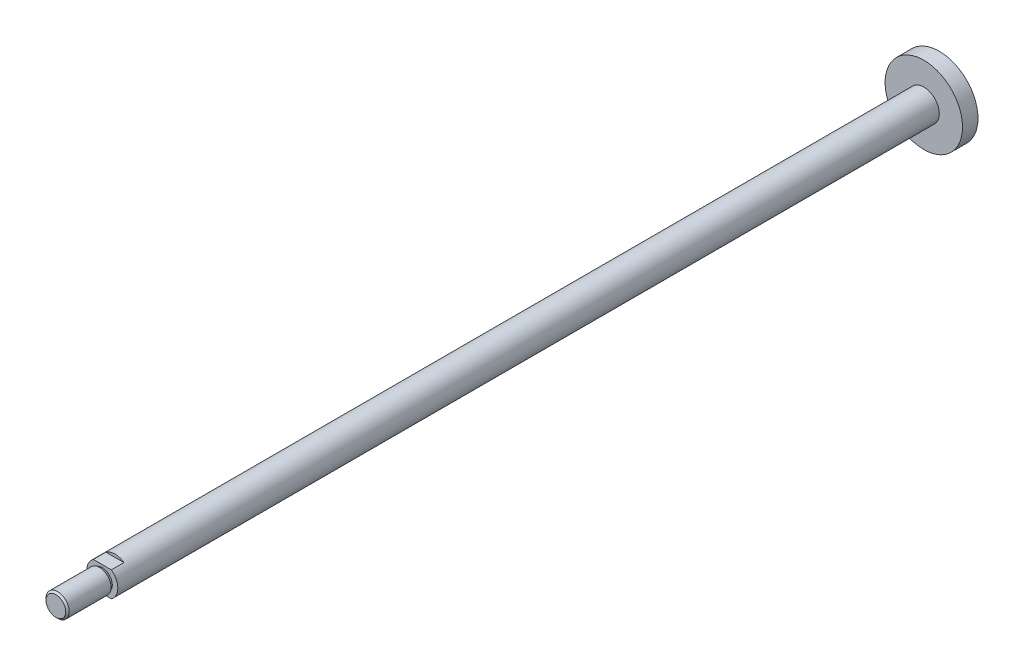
ISO-10303-21;
HEADER;
FILE_DESCRIPTION(('STEP AP214'),'2;1');
FILE_NAME('part.step','',(''),(''),'','','');
FILE_SCHEMA(('AUTOMOTIVE_DESIGN { 1 0 10303 214 1 1 1 1 }'));
ENDSEC;
DATA;
#1=APPLICATION_CONTEXT('core data for automotive mechanical design processes');
#2=APPLICATION_PROTOCOL_DEFINITION('international standard','automotive_design',2000,#1);
#3=PRODUCT_CONTEXT('',#1,'mechanical');
#4=PRODUCT('Part','Part','',(#3));
#5=PRODUCT_RELATED_PRODUCT_CATEGORY('part','',(#4));
#6=PRODUCT_DEFINITION_FORMATION('','',#4);
#7=PRODUCT_DEFINITION_CONTEXT('part definition',#1,'design');
#8=PRODUCT_DEFINITION('design','',#6,#7);
#9=PRODUCT_DEFINITION_SHAPE('','',#8);
#10=(LENGTH_UNIT() NAMED_UNIT(*) SI_UNIT(.MILLI.,.METRE.));
#11=(NAMED_UNIT(*) PLANE_ANGLE_UNIT() SI_UNIT($,.RADIAN.));
#12=(NAMED_UNIT(*) SI_UNIT($,.STERADIAN.) SOLID_ANGLE_UNIT());
#13=UNCERTAINTY_MEASURE_WITH_UNIT(LENGTH_MEASURE(1.E-05),#10,'distance_accuracy_value','');
#14=(GEOMETRIC_REPRESENTATION_CONTEXT(3) GLOBAL_UNCERTAINTY_ASSIGNED_CONTEXT((#13)) GLOBAL_UNIT_ASSIGNED_CONTEXT((#10,
#11,#12)) REPRESENTATION_CONTEXT('',''));
#15=CARTESIAN_POINT('',(0.,0.,0.));
#16=DIRECTION('',(0.,0.,1.));
#17=DIRECTION('',(1.,0.,0.));
#18=AXIS2_PLACEMENT_3D('',#15,#16,#17);
#19=CARTESIAN_POINT('',(0.,2.54999999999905,-96.));
#20=DIRECTION('',(0.,0.,1.));
#21=DIRECTION('',(1.,0.,0.));
#22=AXIS2_PLACEMENT_3D('',#19,#20,#21);
#23=PLANE('',#22);
#24=CARTESIAN_POINT('',(0.,-9.43689570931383E-13,-96.0000000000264));
#25=DIRECTION('',(0.,0.,-1.));
#26=DIRECTION('',(-1.,0.,0.));
#27=AXIS2_PLACEMENT_3D('',#24,#25,#26);
#28=CIRCLE('',#27,5.10000000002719);
#29=CARTESIAN_POINT('',(-5.10000000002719,-9.43689570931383E-13,-96.0000000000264));
#30=VERTEX_POINT('',#29);
#31=EDGE_CURVE('E137',#30,#30,#28,.T.);
#32=ORIENTED_EDGE('',*,*,#31,.F.);
#33=EDGE_LOOP('',(#32));
#34=FACE_BOUND('',#33,.T.);
#35=ADVANCED_FACE('F46',(#34),#23,.T.);
#36=CARTESIAN_POINT('',(0.,-9.43689570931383E-13,-96.899999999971));
#37=DIRECTION('',(0.,0.,-1.));
#38=DIRECTION('',(-1.,0.,0.));
#39=AXIS2_PLACEMENT_3D('',#36,#37,#38);
#40=CONICAL_SURFACE('',#39,6.00000000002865,0.785398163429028);
#41=ORIENTED_EDGE('',*,*,#31,.T.);
#42=EDGE_LOOP('',(#41));
#43=FACE_BOUND('',#42,.T.);
#44=CARTESIAN_POINT('',(0.,-9.43689570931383E-13,-96.9));
#45=DIRECTION('',(0.,0.,1.));
#46=DIRECTION('',(1.,0.,0.));
#47=AXIS2_PLACEMENT_3D('',#44,#45,#46);
#48=CIRCLE('',#47,6.);
#49=CARTESIAN_POINT('',(6.,-9.43689570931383E-13,-96.9));
#50=VERTEX_POINT('',#49);
#51=EDGE_CURVE('E143',#50,#50,#48,.F.);
#52=ORIENTED_EDGE('',*,*,#51,.F.);
#53=EDGE_LOOP('',(#52));
#54=FACE_BOUND('',#53,.T.);
#55=ADVANCED_FACE('F178',(#43,#54),#40,.T.);
#56=CARTESIAN_POINT('',(0.,-9.43689570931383E-13,-107.720577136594));
#57=DIRECTION('',(0.,0.,1.));
#58=DIRECTION('',(1.,0.,0.));
#59=AXIS2_PLACEMENT_3D('',#56,#57,#58);
#60=CYLINDRICAL_SURFACE('',#59,6.);
#61=ORIENTED_EDGE('',*,*,#51,.T.);
#62=EDGE_LOOP('',(#61));
#63=FACE_BOUND('',#62,.T.);
#64=CARTESIAN_POINT('',(-1.88737914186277E-12,0.,-118.541154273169));
#65=DIRECTION('',(0.,0.,1.));
#66=DIRECTION('',(0.,1.,0.));
#67=AXIS2_PLACEMENT_3D('',#64,#65,#66);
#68=CIRCLE('',#67,6.00000000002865);
#69=CARTESIAN_POINT('',(-1.88884866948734E-12,6.00000000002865,-118.541154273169));
#70=VERTEX_POINT('',#69);
#71=EDGE_CURVE('E146',#70,#70,#68,.F.);
#72=ORIENTED_EDGE('',*,*,#71,.F.);
#73=EDGE_LOOP('',(#72));
#74=FACE_BOUND('',#73,.T.);
#75=ADVANCED_FACE('F174',(#63,#74),#60,.T.);
#76=CARTESIAN_POINT('',(-1.88737914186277E-12,0.,-118.541154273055));
#77=DIRECTION('',(0.,0.,1.));
#78=DIRECTION('',(1.,0.,0.));
#79=AXIS2_PLACEMENT_3D('',#76,#77,#78);
#80=CONICAL_SURFACE('',#79,6.00000000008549,0.523598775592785);
#81=ORIENTED_EDGE('',*,*,#71,.T.);
#82=EDGE_LOOP('',(#81));
#83=FACE_BOUND('',#82,.T.);
#84=CARTESIAN_POINT('',(-1.88737914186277E-12,0.,-119.99999999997));
#85=DIRECTION('',(0.,0.,1.));
#86=DIRECTION('',(1.,0.,0.));
#87=AXIS2_PLACEMENT_3D('',#84,#85,#86);
#88=CIRCLE('',#87,5.15773502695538);
#89=CARTESIAN_POINT('',(5.15773502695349,0.,-119.99999999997));
#90=VERTEX_POINT('',#89);
#91=EDGE_CURVE('E121',#90,#90,#88,.F.);
#92=ORIENTED_EDGE('',*,*,#91,.F.);
#93=EDGE_LOOP('',(#92));
#94=FACE_BOUND('',#93,.T.);
#95=ADVANCED_FACE('F170',(#83,#94),#80,.T.);
#96=CARTESIAN_POINT('',(0.,-9.43689570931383E-13,-126.5));
#97=DIRECTION('',(0.,0.,1.));
#98=DIRECTION('',(1.,0.,0.));
#99=AXIS2_PLACEMENT_3D('',#96,#97,#98);
#100=PLANE('',#99);
#101=DIRECTION('',(1.,0.,0.));
#102=VECTOR('',#101,1.);
#103=CARTESIAN_POINT('',(-16.,6.49999999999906,-126.500000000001));
#104=LINE('',#103,#102);
#105=CARTESIAN_POINT('',(-4.66368952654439,6.49999999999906,-126.5));
#106=VERTEX_POINT('',#105);
#107=CARTESIAN_POINT('',(4.66368952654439,6.49999999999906,-126.5));
#108=VERTEX_POINT('',#107);
#109=EDGE_CURVE('E100',#106,#108,#104,.T.);
#110=ORIENTED_EDGE('',*,*,#109,.T.);
#111=CARTESIAN_POINT('',(0.,-9.43689570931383E-13,-126.5));
#112=DIRECTION('',(0.,0.,1.));
#113=DIRECTION('',(1.,0.,0.));
#114=AXIS2_PLACEMENT_3D('',#111,#112,#113);
#115=CIRCLE('',#114,8.);
#116=EDGE_CURVE('E110',#106,#108,#115,.F.);
#117=ORIENTED_EDGE('',*,*,#116,.F.);
#118=EDGE_LOOP('',(#110,#117));
#119=FACE_BOUND('',#118,.T.);
#120=ADVANCED_FACE('F167',(#119),#100,.T.);
#121=CARTESIAN_POINT('',(-16.,6.49999999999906,-113.500000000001));
#122=DIRECTION('',(0.,-1.,0.));
#123=DIRECTION('',(0.,0.,-1.));
#124=AXIS2_PLACEMENT_3D('',#121,#122,#123);
#125=PLANE('',#124);
#126=DIRECTION('',(1.,0.,0.));
#127=VECTOR('',#126,1.);
#128=CARTESIAN_POINT('',(-1.88737914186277E-12,6.50000000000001,-120.));
#129=LINE('',#128,#127);
#130=CARTESIAN_POINT('',(4.66368952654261,6.50000000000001,-120.000000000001));
#131=VERTEX_POINT('',#130);
#132=CARTESIAN_POINT('',(-4.66368952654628,6.50000000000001,-120.));
#133=VERTEX_POINT('',#132);
#134=EDGE_CURVE('E50',#131,#133,#129,.F.);
#135=ORIENTED_EDGE('',*,*,#134,.F.);
#136=DIRECTION('',(0.,0.,1.));
#137=VECTOR('',#136,1.);
#138=CARTESIAN_POINT('',(4.66368952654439,6.50000000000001,-411.200000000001));
#139=LINE('',#138,#137);
#140=EDGE_CURVE('E91',#108,#131,#139,.T.);
#141=ORIENTED_EDGE('',*,*,#140,.F.);
#142=ORIENTED_EDGE('',*,*,#109,.F.);
#143=DIRECTION('',(0.,0.,1.));
#144=VECTOR('',#143,1.);
#145=CARTESIAN_POINT('',(-4.66368952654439,6.50000000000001,-411.200000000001));
#146=LINE('',#145,#144);
#147=EDGE_CURVE('E94',#133,#106,#146,.F.);
#148=ORIENTED_EDGE('',*,*,#147,.F.);
#149=EDGE_LOOP('',(#135,#141,#142,#148));
#150=FACE_BOUND('',#149,.T.);
#151=ADVANCED_FACE('F88',(#150),#125,.F.);
#152=CARTESIAN_POINT('',(-1.88737914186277E-12,4.,-120.000000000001));
#153=DIRECTION('',(0.,0.,1.));
#154=DIRECTION('',(1.,0.,0.));
#155=AXIS2_PLACEMENT_3D('',#152,#153,#154);
#156=PLANE('',#155);
#157=ORIENTED_EDGE('',*,*,#134,.T.);
#158=CARTESIAN_POINT('',(-1.88737914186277E-12,0.,-120.));
#159=DIRECTION('',(0.,0.,1.));
#160=DIRECTION('',(1.,0.,0.));
#161=AXIS2_PLACEMENT_3D('',#158,#159,#160);
#162=CIRCLE('',#161,8.);
#163=CARTESIAN_POINT('',(-4.66368952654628,-6.50000000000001,-120.));
#164=VERTEX_POINT('',#163);
#165=EDGE_CURVE('E57',#164,#133,#162,.F.);
#166=ORIENTED_EDGE('',*,*,#165,.F.);
#167=DIRECTION('',(1.,0.,0.));
#168=VECTOR('',#167,1.);
#169=CARTESIAN_POINT('',(15.9999999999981,-6.50000000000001,-120.));
#170=LINE('',#169,#168);
#171=CARTESIAN_POINT('',(4.66368952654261,-6.50000000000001,-120.000000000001));
#172=VERTEX_POINT('',#171);
#173=EDGE_CURVE('E99',#164,#172,#170,.T.);
#174=ORIENTED_EDGE('',*,*,#173,.T.);
#175=CARTESIAN_POINT('',(-1.88737914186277E-12,0.,-120.));
#176=DIRECTION('',(0.,0.,1.));
#177=DIRECTION('',(1.,0.,0.));
#178=AXIS2_PLACEMENT_3D('',#175,#176,#177);
#179=CIRCLE('',#178,8.);
#180=EDGE_CURVE('E102',#131,#172,#179,.F.);
#181=ORIENTED_EDGE('',*,*,#180,.F.);
#182=EDGE_LOOP('',(#157,#166,#174,#181));
#183=FACE_BOUND('',#182,.T.);
#184=ORIENTED_EDGE('',*,*,#91,.T.);
#185=EDGE_LOOP('',(#184));
#186=FACE_BOUND('',#185,.T.);
#187=ADVANCED_FACE('F103',(#183,#186),#156,.T.);
#188=CARTESIAN_POINT('',(15.9999999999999,-6.50000000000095,-113.5));
#189=DIRECTION('',(0.,1.,0.));
#190=DIRECTION('',(0.,0.,1.));
#191=AXIS2_PLACEMENT_3D('',#188,#189,#190);
#192=PLANE('',#191);
#193=DIRECTION('',(1.,0.,0.));
#194=VECTOR('',#193,1.);
#195=CARTESIAN_POINT('',(0.,-6.50000000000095,-126.5));
#196=LINE('',#195,#194);
#197=CARTESIAN_POINT('',(4.66368952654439,-6.50000000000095,-126.5));
#198=VERTEX_POINT('',#197);
#199=CARTESIAN_POINT('',(-4.66368952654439,-6.50000000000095,-126.5));
#200=VERTEX_POINT('',#199);
#201=EDGE_CURVE('E123',#198,#200,#196,.F.);
#202=ORIENTED_EDGE('',*,*,#201,.F.);
#203=DIRECTION('',(0.,0.,1.));
#204=VECTOR('',#203,1.);
#205=CARTESIAN_POINT('',(4.66368952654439,-6.50000000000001,-411.2));
#206=LINE('',#205,#204);
#207=EDGE_CURVE('E107',#172,#198,#206,.F.);
#208=ORIENTED_EDGE('',*,*,#207,.F.);
#209=ORIENTED_EDGE('',*,*,#173,.F.);
#210=DIRECTION('',(0.,0.,1.));
#211=VECTOR('',#210,1.);
#212=CARTESIAN_POINT('',(-4.66368952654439,-6.50000000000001,-411.2));
#213=LINE('',#212,#211);
#214=EDGE_CURVE('E139',#200,#164,#213,.T.);
#215=ORIENTED_EDGE('',*,*,#214,.F.);
#216=EDGE_LOOP('',(#202,#208,#209,#215));
#217=FACE_BOUND('',#216,.T.);
#218=ADVANCED_FACE('F151',(#217),#192,.F.);
#219=CARTESIAN_POINT('',(0.,-9.43689570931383E-13,-126.5));
#220=DIRECTION('',(0.,0.,1.));
#221=DIRECTION('',(1.,0.,0.));
#222=AXIS2_PLACEMENT_3D('',#219,#220,#221);
#223=PLANE('',#222);
#224=ORIENTED_EDGE('',*,*,#201,.T.);
#225=CARTESIAN_POINT('',(0.,-9.43689570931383E-13,-126.5));
#226=DIRECTION('',(0.,0.,1.));
#227=DIRECTION('',(1.,0.,0.));
#228=AXIS2_PLACEMENT_3D('',#225,#226,#227);
#229=CIRCLE('',#228,8.);
#230=EDGE_CURVE('E66',#198,#200,#229,.F.);
#231=ORIENTED_EDGE('',*,*,#230,.F.);
#232=EDGE_LOOP('',(#224,#231));
#233=FACE_BOUND('',#232,.T.);
#234=ADVANCED_FACE('F152',(#233),#223,.T.);
#235=CARTESIAN_POINT('',(0.,0.,-411.2));
#236=DIRECTION('',(0.,0.,1.));
#237=DIRECTION('',(1.,0.,0.));
#238=AXIS2_PLACEMENT_3D('',#235,#236,#237);
#239=CYLINDRICAL_SURFACE('',#238,8.);
#240=CARTESIAN_POINT('',(-1.88737914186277E-12,-9.43689570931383E-13,-544.5));
#241=DIRECTION('',(0.,0.,1.));
#242=DIRECTION('',(1.,0.,0.));
#243=AXIS2_PLACEMENT_3D('',#240,#241,#242);
#244=CIRCLE('',#243,8.);
#245=CARTESIAN_POINT('',(7.99999999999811,-9.43689570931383E-13,-544.5));
#246=VERTEX_POINT('',#245);
#247=EDGE_CURVE('E12',#246,#246,#244,.F.);
#248=ORIENTED_EDGE('',*,*,#247,.F.);
#249=EDGE_LOOP('',(#248));
#250=FACE_BOUND('',#249,.T.);
#251=ORIENTED_EDGE('',*,*,#147,.T.);
#252=ORIENTED_EDGE('',*,*,#116,.T.);
#253=ORIENTED_EDGE('',*,*,#140,.T.);
#254=ORIENTED_EDGE('',*,*,#180,.T.);
#255=ORIENTED_EDGE('',*,*,#207,.T.);
#256=ORIENTED_EDGE('',*,*,#230,.T.);
#257=ORIENTED_EDGE('',*,*,#214,.T.);
#258=ORIENTED_EDGE('',*,*,#165,.T.);
#259=EDGE_LOOP('',(#251,#252,#253,#254,#255,#256,#257,#258));
#260=FACE_BOUND('',#259,.T.);
#261=ADVANCED_FACE('F109',(#250,#260),#239,.T.);
#262=CARTESIAN_POINT('',(-20.0000000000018,-10.0000000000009,-544.5));
#263=DIRECTION('',(0.,0.,1.));
#264=DIRECTION('',(1.,0.,0.));
#265=AXIS2_PLACEMENT_3D('',#262,#263,#264);
#266=PLANE('',#265);
#267=ORIENTED_EDGE('',*,*,#247,.T.);
#268=EDGE_LOOP('',(#267));
#269=FACE_BOUND('',#268,.T.);
#270=ADVANCED_FACE('F48',(#269),#266,.F.);
#271=CLOSED_SHELL('',(#35,#55,#75,#95,#120,#151,#187,#218,#234,#261,#270));
#272=MANIFOLD_SOLID_BREP('B2',#271);
#273=CARTESIAN_POINT('',(0.,9.99999999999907,-552.500000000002));
#274=DIRECTION('',(0.,0.,-1.));
#275=DIRECTION('',(-1.,0.,0.));
#276=AXIS2_PLACEMENT_3D('',#273,#274,#275);
#277=PLANE('',#276);
#278=CARTESIAN_POINT('',(0.,-9.43689570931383E-13,-552.5));
#279=DIRECTION('',(0.,0.,1.));
#280=DIRECTION('',(1.,0.,0.));
#281=AXIS2_PLACEMENT_3D('',#278,#279,#280);
#282=CIRCLE('',#281,20.);
#283=CARTESIAN_POINT('',(20.,-9.43689570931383E-13,-552.5));
#284=VERTEX_POINT('',#283);
#285=EDGE_CURVE('E276',#284,#284,#282,.T.);
#286=ORIENTED_EDGE('',*,*,#285,.F.);
#287=EDGE_LOOP('',(#286));
#288=FACE_BOUND('',#287,.T.);
#289=ADVANCED_FACE('F272',(#288),#277,.T.);
#290=CARTESIAN_POINT('',(-1.88737914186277E-12,9.99999999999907,-544.500000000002));
#291=DIRECTION('',(0.,0.,1.));
#292=DIRECTION('',(1.,0.,0.));
#293=AXIS2_PLACEMENT_3D('',#290,#291,#292);
#294=PLANE('',#293);
#295=CARTESIAN_POINT('',(-1.88737914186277E-12,-9.43689570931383E-13,-544.5));
#296=DIRECTION('',(0.,0.,1.));
#297=DIRECTION('',(1.,0.,0.));
#298=AXIS2_PLACEMENT_3D('',#295,#296,#297);
#299=CIRCLE('',#298,20.);
#300=CARTESIAN_POINT('',(19.9999999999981,-9.43689570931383E-13,-544.5));
#301=VERTEX_POINT('',#300);
#302=EDGE_CURVE('E45',#301,#301,#299,.T.);
#303=ORIENTED_EDGE('',*,*,#302,.T.);
#304=EDGE_LOOP('',(#303));
#305=FACE_BOUND('',#304,.T.);
#306=ADVANCED_FACE('F274',(#305),#294,.T.);
#307=CARTESIAN_POINT('',(0.,0.,-548.5));
#308=DIRECTION('',(0.,0.,1.));
#309=DIRECTION('',(1.,0.,0.));
#310=AXIS2_PLACEMENT_3D('',#307,#308,#309);
#311=CYLINDRICAL_SURFACE('',#310,20.);
#312=ORIENTED_EDGE('',*,*,#302,.F.);
#313=EDGE_LOOP('',(#312));
#314=FACE_BOUND('',#313,.T.);
#315=ORIENTED_EDGE('',*,*,#285,.T.);
#316=EDGE_LOOP('',(#315));
#317=FACE_BOUND('',#316,.T.);
#318=ADVANCED_FACE('F287',(#314,#317),#311,.T.);
#319=CLOSED_SHELL('',(#289,#306,#318));
#320=MANIFOLD_SOLID_BREP('B6',#319);
#321=ADVANCED_BREP_SHAPE_REPRESENTATION('',(#18,#272,#320),#14);
#322=SHAPE_DEFINITION_REPRESENTATION(#9,#321);
ENDSEC;
END-ISO-10303-21;
